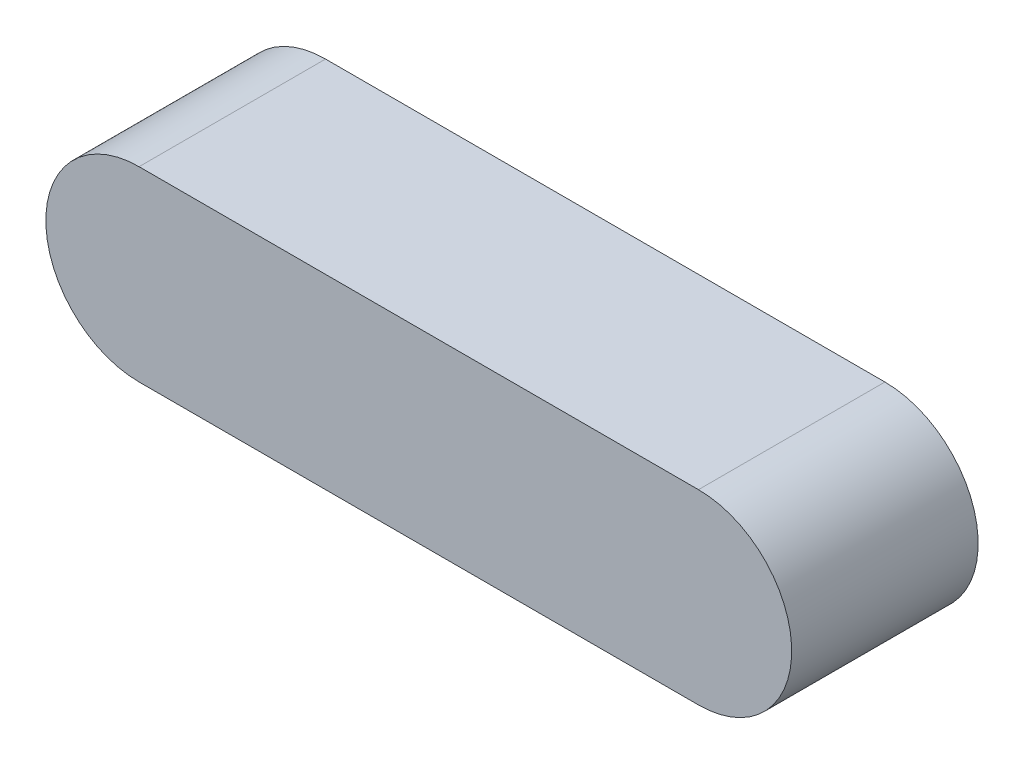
from build123d import *

# Parameters (mm, degrees)
EXTRUSION1_DEPTH      = 1.5
EXTRUSION1_DEPTH_BACK = 1.5


with BuildPart() as part:
    # Esquisse1 → Extrusion1 (new, two sides: drawn at the far end of the back side and taken through both)
    with BuildSketch(Plane.XY.offset(-EXTRUSION1_DEPTH_BACK)):
        with BuildLine():
            Line((-4.5, 1.5), (4.5, 1.5))
            ThreePointArc((4.5, 1.5), (6, 0), (4.5, -1.5))
            Line((4.5, -1.5), (-4.5, -1.5))
            ThreePointArc((-4.5, -1.5), (-6, 0), (-4.5, 1.5))
        make_face()
    extrude(amount=EXTRUSION1_DEPTH + EXTRUSION1_DEPTH_BACK)


solid = part.part
